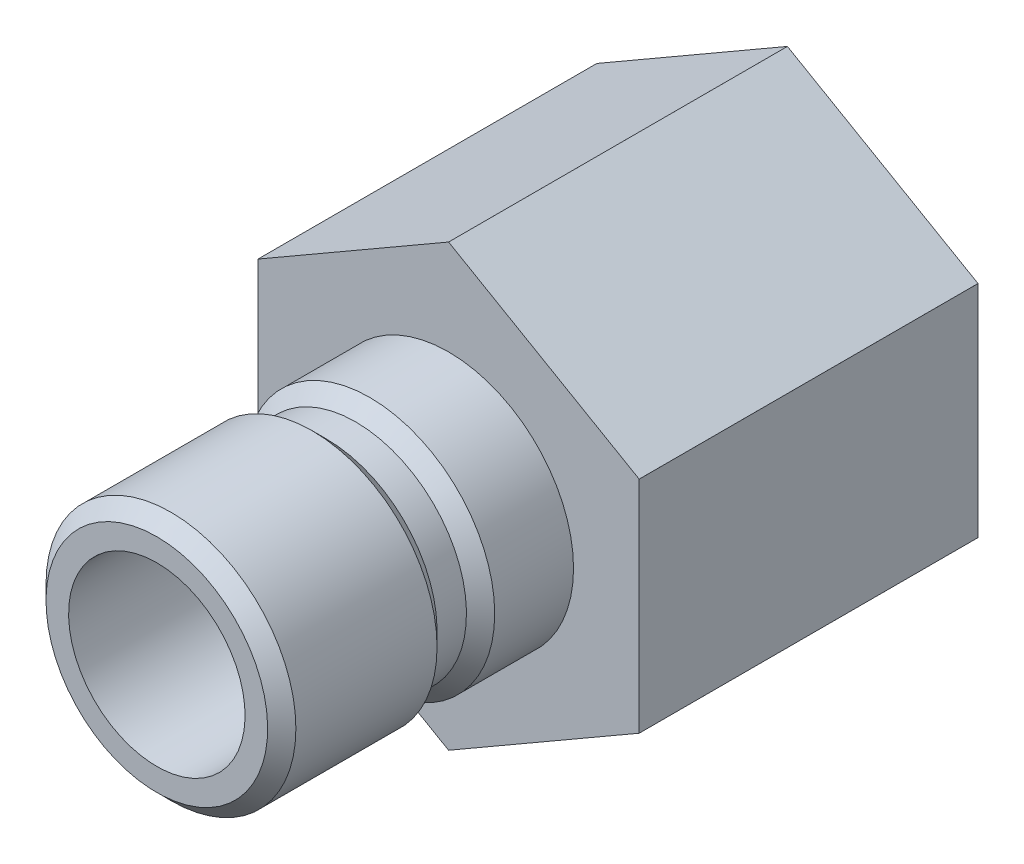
from build123d import *

# Parameters (mm, degrees)
SKETCH2_OUTSIDE_W  = 35.32
SKETCH2_OUTSIDE_H  = 35.32
CUT_EXTRUDE1_DEPTH = 25.832225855


with BuildPart() as part:
    # Sketch1 → Revolve1 (revolve)
    with BuildSketch(Plane(origin=(0, 0, 0), x_dir=(0, 0, -1), z_dir=(1, 0, 0))):
        Polygon((-15.748, 4.7625), (-15.748, 5.9817), (-14.986, 6.7437), (-7.366, 6.7437), (-6.604, 5.9817), (-5.0165, 5.9817), (-4.2545, 6.7437), (0, 6.7437), (0, 11.87831), (18.288, 11.87831), (18.288, 7.714533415), (6.3627, 7.34187), (6.3627, 4.7625), align=None)
    revolve(axis=Axis((0, 0, 0), (0, 0, 1)))

    # Sketch2 outside → Cut-Extrude1 (cut, through all)
    with BuildSketch(Plane.XY):
        Rectangle(SKETCH2_OUTSIDE_W, SKETCH2_OUTSIDE_H)
        Polygon((-10.287, 5.939202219), (-10.287, -5.939202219), (0, -11.878404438), (10.287, -5.939202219), (10.287, 5.939202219), (0, 11.878404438), align=None, mode=Mode.SUBTRACT)
    extrude(amount=-CUT_EXTRUDE1_DEPTH, mode=Mode.SUBTRACT)


solid = part.part
